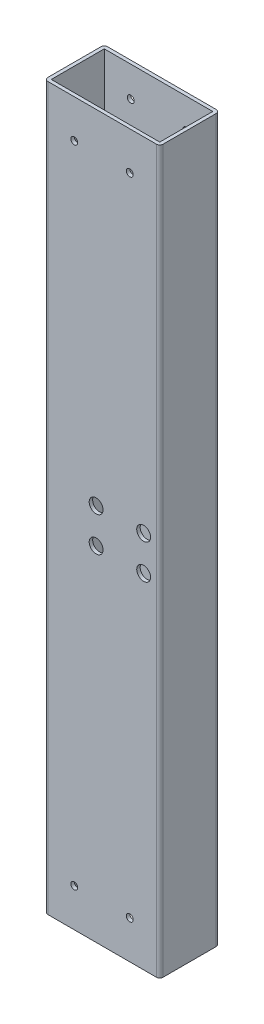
ISO-10303-21;
HEADER;
FILE_DESCRIPTION(('STEP AP214'),'2;1');
FILE_NAME('part.step','',(''),(''),'','','');
FILE_SCHEMA(('AUTOMOTIVE_DESIGN { 1 0 10303 214 1 1 1 1 }'));
ENDSEC;
DATA;
#1=APPLICATION_CONTEXT('core data for automotive mechanical design processes');
#2=APPLICATION_PROTOCOL_DEFINITION('international standard','automotive_design',2000,#1);
#3=PRODUCT_CONTEXT('',#1,'mechanical');
#4=PRODUCT('Part','Part','',(#3));
#5=PRODUCT_RELATED_PRODUCT_CATEGORY('part','',(#4));
#6=PRODUCT_DEFINITION_FORMATION('','',#4);
#7=PRODUCT_DEFINITION_CONTEXT('part definition',#1,'design');
#8=PRODUCT_DEFINITION('design','',#6,#7);
#9=PRODUCT_DEFINITION_SHAPE('','',#8);
#10=(LENGTH_UNIT() NAMED_UNIT(*) SI_UNIT(.MILLI.,.METRE.));
#11=(NAMED_UNIT(*) PLANE_ANGLE_UNIT() SI_UNIT($,.RADIAN.));
#12=(NAMED_UNIT(*) SI_UNIT($,.STERADIAN.) SOLID_ANGLE_UNIT());
#13=UNCERTAINTY_MEASURE_WITH_UNIT(LENGTH_MEASURE(1.E-05),#10,'distance_accuracy_value','');
#14=(GEOMETRIC_REPRESENTATION_CONTEXT(3) GLOBAL_UNCERTAINTY_ASSIGNED_CONTEXT((#13)) GLOBAL_UNIT_ASSIGNED_CONTEXT((#10,
#11,#12)) REPRESENTATION_CONTEXT('',''));
#15=CARTESIAN_POINT('',(0.,0.,0.));
#16=DIRECTION('',(0.,0.,1.));
#17=DIRECTION('',(1.,0.,0.));
#18=AXIS2_PLACEMENT_3D('',#15,#16,#17);
#19=CARTESIAN_POINT('',(-24.8285,165.1,12.1285));
#20=DIRECTION('',(0.,1.,0.));
#21=DIRECTION('',(0.,0.,1.));
#22=AXIS2_PLACEMENT_3D('',#19,#20,#21);
#23=PLANE('',#22);
#24=CARTESIAN_POINT('',(-24.8285,165.1,12.1285));
#25=DIRECTION('',(0.,1.,0.));
#26=DIRECTION('',(0.,0.,-1.));
#27=AXIS2_PLACEMENT_3D('',#24,#25,#26);
#28=CIRCLE('',#27,1.5875);
#29=CARTESIAN_POINT('',(-26.416,165.1,12.1285));
#30=VERTEX_POINT('',#29);
#31=CARTESIAN_POINT('',(-24.8285,165.1,13.716));
#32=VERTEX_POINT('',#31);
#33=EDGE_CURVE('E210',#30,#32,#28,.T.);
#34=ORIENTED_EDGE('',*,*,#33,.T.);
#35=DIRECTION('',(1.,0.,0.));
#36=VECTOR('',#35,1.);
#37=CARTESIAN_POINT('',(-24.8285,165.1,13.716));
#38=LINE('',#37,#36);
#39=CARTESIAN_POINT('',(24.8285,165.1,13.716));
#40=VERTEX_POINT('',#39);
#41=EDGE_CURVE('E213',#32,#40,#38,.T.);
#42=ORIENTED_EDGE('',*,*,#41,.T.);
#43=CARTESIAN_POINT('',(24.8285,165.1,12.1285));
#44=DIRECTION('',(0.,1.,0.));
#45=DIRECTION('',(0.,0.,1.));
#46=AXIS2_PLACEMENT_3D('',#43,#44,#45);
#47=CIRCLE('',#46,1.5875);
#48=CARTESIAN_POINT('',(26.416,165.1,12.1285));
#49=VERTEX_POINT('',#48);
#50=EDGE_CURVE('E216',#40,#49,#47,.T.);
#51=ORIENTED_EDGE('',*,*,#50,.T.);
#52=DIRECTION('',(0.,0.,-1.));
#53=VECTOR('',#52,1.);
#54=CARTESIAN_POINT('',(26.416,165.1,12.1285));
#55=LINE('',#54,#53);
#56=CARTESIAN_POINT('',(26.416,165.1,-12.1285));
#57=VERTEX_POINT('',#56);
#58=EDGE_CURVE('E218',#49,#57,#55,.T.);
#59=ORIENTED_EDGE('',*,*,#58,.T.);
#60=CARTESIAN_POINT('',(24.8285,165.1,-12.1285));
#61=DIRECTION('',(0.,1.,0.));
#62=DIRECTION('',(0.,0.,-1.));
#63=AXIS2_PLACEMENT_3D('',#60,#61,#62);
#64=CIRCLE('',#63,1.5875);
#65=CARTESIAN_POINT('',(24.8285,165.1,-13.716));
#66=VERTEX_POINT('',#65);
#67=EDGE_CURVE('E220',#57,#66,#64,.T.);
#68=ORIENTED_EDGE('',*,*,#67,.T.);
#69=DIRECTION('',(-1.,0.,0.));
#70=VECTOR('',#69,1.);
#71=CARTESIAN_POINT('',(-24.8285,165.1,-13.716));
#72=LINE('',#71,#70);
#73=CARTESIAN_POINT('',(-24.8285,165.1,-13.716));
#74=VERTEX_POINT('',#73);
#75=EDGE_CURVE('E222',#66,#74,#72,.T.);
#76=ORIENTED_EDGE('',*,*,#75,.T.);
#77=CARTESIAN_POINT('',(-24.8285,165.1,-12.1285));
#78=DIRECTION('',(0.,1.,0.));
#79=DIRECTION('',(0.,0.,-1.));
#80=AXIS2_PLACEMENT_3D('',#77,#78,#79);
#81=CIRCLE('',#80,1.5875);
#82=CARTESIAN_POINT('',(-26.416,165.1,-12.1285));
#83=VERTEX_POINT('',#82);
#84=EDGE_CURVE('E224',#74,#83,#81,.T.);
#85=ORIENTED_EDGE('',*,*,#84,.T.);
#86=DIRECTION('',(0.,0.,1.));
#87=VECTOR('',#86,1.);
#88=CARTESIAN_POINT('',(-26.416,165.1,12.1285));
#89=LINE('',#88,#87);
#90=EDGE_CURVE('E226',#83,#30,#89,.T.);
#91=ORIENTED_EDGE('',*,*,#90,.T.);
#92=EDGE_LOOP('',(#34,#42,#51,#59,#68,#76,#85,#91));
#93=FACE_BOUND('',#92,.T.);
#94=DIRECTION('',(1.,0.,0.));
#95=VECTOR('',#94,1.);
#96=CARTESIAN_POINT('',(-24.8285,165.1,12.1285));
#97=LINE('',#96,#95);
#98=CARTESIAN_POINT('',(-24.8285,165.1,12.1285));
#99=VERTEX_POINT('',#98);
#100=CARTESIAN_POINT('',(24.8285,165.1,12.1285));
#101=VERTEX_POINT('',#100);
#102=EDGE_CURVE('E180',#99,#101,#97,.T.);
#103=ORIENTED_EDGE('',*,*,#102,.F.);
#104=DIRECTION('',(0.,0.,1.));
#105=VECTOR('',#104,1.);
#106=CARTESIAN_POINT('',(-24.8285,165.1,12.1285));
#107=LINE('',#106,#105);
#108=CARTESIAN_POINT('',(-24.8285,165.1,-12.1285));
#109=VERTEX_POINT('',#108);
#110=EDGE_CURVE('E172',#109,#99,#107,.T.);
#111=ORIENTED_EDGE('',*,*,#110,.F.);
#112=DIRECTION('',(-1.,0.,0.));
#113=VECTOR('',#112,1.);
#114=CARTESIAN_POINT('',(-24.8285,165.1,-12.1285));
#115=LINE('',#114,#113);
#116=CARTESIAN_POINT('',(24.8285,165.1,-12.1285));
#117=VERTEX_POINT('',#116);
#118=EDGE_CURVE('E194',#117,#109,#115,.T.);
#119=ORIENTED_EDGE('',*,*,#118,.F.);
#120=DIRECTION('',(0.,0.,-1.));
#121=VECTOR('',#120,1.);
#122=CARTESIAN_POINT('',(24.8285,165.1,12.1285));
#123=LINE('',#122,#121);
#124=EDGE_CURVE('E192',#101,#117,#123,.T.);
#125=ORIENTED_EDGE('',*,*,#124,.F.);
#126=EDGE_LOOP('',(#103,#111,#119,#125));
#127=FACE_BOUND('',#126,.T.);
#128=ADVANCED_FACE('F81',(#93,#127),#23,.T.);
#129=CARTESIAN_POINT('',(-24.8285,-165.1,12.1285));
#130=DIRECTION('',(0.,1.,0.));
#131=DIRECTION('',(0.,0.,1.));
#132=AXIS2_PLACEMENT_3D('',#129,#130,#131);
#133=PLANE('',#132);
#134=CARTESIAN_POINT('',(-24.8285,-165.1,12.1285));
#135=DIRECTION('',(0.,1.,0.));
#136=DIRECTION('',(0.,0.,-1.));
#137=AXIS2_PLACEMENT_3D('',#134,#135,#136);
#138=CIRCLE('',#137,1.5875);
#139=CARTESIAN_POINT('',(-26.416,-165.1,12.1285));
#140=VERTEX_POINT('',#139);
#141=CARTESIAN_POINT('',(-24.8285,-165.1,13.716));
#142=VERTEX_POINT('',#141);
#143=EDGE_CURVE('E188',#140,#142,#138,.T.);
#144=ORIENTED_EDGE('',*,*,#143,.F.);
#145=DIRECTION('',(0.,0.,1.));
#146=VECTOR('',#145,1.);
#147=CARTESIAN_POINT('',(-26.416,-165.1,12.1285));
#148=LINE('',#147,#146);
#149=CARTESIAN_POINT('',(-26.416,-165.1,-12.1285));
#150=VERTEX_POINT('',#149);
#151=EDGE_CURVE('E214',#150,#140,#148,.T.);
#152=ORIENTED_EDGE('',*,*,#151,.F.);
#153=CARTESIAN_POINT('',(-24.8285,-165.1,-12.1285));
#154=DIRECTION('',(0.,1.,0.));
#155=DIRECTION('',(0.,0.,-1.));
#156=AXIS2_PLACEMENT_3D('',#153,#154,#155);
#157=CIRCLE('',#156,1.5875);
#158=CARTESIAN_POINT('',(-24.8285,-165.1,-13.716));
#159=VERTEX_POINT('',#158);
#160=EDGE_CURVE('E241',#159,#150,#157,.T.);
#161=ORIENTED_EDGE('',*,*,#160,.F.);
#162=DIRECTION('',(-1.,0.,0.));
#163=VECTOR('',#162,1.);
#164=CARTESIAN_POINT('',(-24.8285,-165.1,-13.716));
#165=LINE('',#164,#163);
#166=CARTESIAN_POINT('',(24.8285,-165.1,-13.716));
#167=VERTEX_POINT('',#166);
#168=EDGE_CURVE('E239',#167,#159,#165,.T.);
#169=ORIENTED_EDGE('',*,*,#168,.F.);
#170=CARTESIAN_POINT('',(24.8285,-165.1,-12.1285));
#171=DIRECTION('',(0.,1.,0.));
#172=DIRECTION('',(0.,0.,-1.));
#173=AXIS2_PLACEMENT_3D('',#170,#171,#172);
#174=CIRCLE('',#173,1.5875);
#175=CARTESIAN_POINT('',(26.416,-165.1,-12.1285));
#176=VERTEX_POINT('',#175);
#177=EDGE_CURVE('E237',#176,#167,#174,.T.);
#178=ORIENTED_EDGE('',*,*,#177,.F.);
#179=DIRECTION('',(0.,0.,-1.));
#180=VECTOR('',#179,1.);
#181=CARTESIAN_POINT('',(26.416,-165.1,12.1285));
#182=LINE('',#181,#180);
#183=CARTESIAN_POINT('',(26.416,-165.1,12.1285));
#184=VERTEX_POINT('',#183);
#185=EDGE_CURVE('E235',#184,#176,#182,.T.);
#186=ORIENTED_EDGE('',*,*,#185,.F.);
#187=CARTESIAN_POINT('',(24.8285,-165.1,12.1285));
#188=DIRECTION('',(0.,1.,0.));
#189=DIRECTION('',(0.,0.,1.));
#190=AXIS2_PLACEMENT_3D('',#187,#188,#189);
#191=CIRCLE('',#190,1.5875);
#192=CARTESIAN_POINT('',(24.8285,-165.1,13.716));
#193=VERTEX_POINT('',#192);
#194=EDGE_CURVE('E233',#193,#184,#191,.T.);
#195=ORIENTED_EDGE('',*,*,#194,.F.);
#196=DIRECTION('',(1.,0.,0.));
#197=VECTOR('',#196,1.);
#198=CARTESIAN_POINT('',(-24.8285,-165.1,13.716));
#199=LINE('',#198,#197);
#200=EDGE_CURVE('E231',#142,#193,#199,.T.);
#201=ORIENTED_EDGE('',*,*,#200,.F.);
#202=EDGE_LOOP('',(#144,#152,#161,#169,#178,#186,#195,#201));
#203=FACE_BOUND('',#202,.T.);
#204=DIRECTION('',(0.,0.,1.));
#205=VECTOR('',#204,1.);
#206=CARTESIAN_POINT('',(-24.8285,-165.1,12.1285));
#207=LINE('',#206,#205);
#208=CARTESIAN_POINT('',(-24.8285,-165.1,-12.1285));
#209=VERTEX_POINT('',#208);
#210=CARTESIAN_POINT('',(-24.8285,-165.1,12.1285));
#211=VERTEX_POINT('',#210);
#212=EDGE_CURVE('E106',#209,#211,#207,.T.);
#213=ORIENTED_EDGE('',*,*,#212,.T.);
#214=DIRECTION('',(1.,0.,0.));
#215=VECTOR('',#214,1.);
#216=CARTESIAN_POINT('',(-24.8285,-165.1,12.1285));
#217=LINE('',#216,#215);
#218=CARTESIAN_POINT('',(24.8285,-165.1,12.1285));
#219=VERTEX_POINT('',#218);
#220=EDGE_CURVE('E187',#211,#219,#217,.T.);
#221=ORIENTED_EDGE('',*,*,#220,.T.);
#222=DIRECTION('',(0.,0.,-1.));
#223=VECTOR('',#222,1.);
#224=CARTESIAN_POINT('',(24.8285,-165.1,12.1285));
#225=LINE('',#224,#223);
#226=CARTESIAN_POINT('',(24.8285,-165.1,-12.1285));
#227=VERTEX_POINT('',#226);
#228=EDGE_CURVE('E202',#219,#227,#225,.T.);
#229=ORIENTED_EDGE('',*,*,#228,.T.);
#230=DIRECTION('',(-1.,0.,0.));
#231=VECTOR('',#230,1.);
#232=CARTESIAN_POINT('',(-24.8285,-165.1,-12.1285));
#233=LINE('',#232,#231);
#234=EDGE_CURVE('E181',#227,#209,#233,.T.);
#235=ORIENTED_EDGE('',*,*,#234,.T.);
#236=EDGE_LOOP('',(#213,#221,#229,#235));
#237=FACE_BOUND('',#236,.T.);
#238=ADVANCED_FACE('F357',(#203,#237),#133,.F.);
#239=CARTESIAN_POINT('',(-24.8285,165.1,12.1285));
#240=DIRECTION('',(0.,-1.,0.));
#241=DIRECTION('',(0.,0.,-1.));
#242=AXIS2_PLACEMENT_3D('',#239,#240,#241);
#243=CYLINDRICAL_SURFACE('',#242,1.5875);
#244=ORIENTED_EDGE('',*,*,#143,.T.);
#245=DIRECTION('',(0.,-1.,0.));
#246=VECTOR('',#245,1.);
#247=CARTESIAN_POINT('',(-24.8285,165.1,13.716));
#248=LINE('',#247,#246);
#249=EDGE_CURVE('E12',#32,#142,#248,.T.);
#250=ORIENTED_EDGE('',*,*,#249,.F.);
#251=ORIENTED_EDGE('',*,*,#33,.F.);
#252=DIRECTION('',(0.,-1.,0.));
#253=VECTOR('',#252,1.);
#254=CARTESIAN_POINT('',(-26.416,165.1,12.1285));
#255=LINE('',#254,#253);
#256=EDGE_CURVE('E228',#30,#140,#255,.T.);
#257=ORIENTED_EDGE('',*,*,#256,.T.);
#258=EDGE_LOOP('',(#244,#250,#251,#257));
#259=FACE_BOUND('',#258,.T.);
#260=ADVANCED_FACE('F83',(#259),#243,.T.);
#261=CARTESIAN_POINT('',(-24.8285,165.1,13.716));
#262=DIRECTION('',(0.,0.,-1.));
#263=DIRECTION('',(-1.,0.,0.));
#264=AXIS2_PLACEMENT_3D('',#261,#262,#263);
#265=PLANE('',#264);
#266=CARTESIAN_POINT('',(-2.69999999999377,7.93750000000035,13.716));
#267=DIRECTION('',(0.,0.,-1.));
#268=DIRECTION('',(-1.,0.,0.));
#269=AXIS2_PLACEMENT_3D('',#266,#267,#268);
#270=CIRCLE('',#269,3.175);
#271=CARTESIAN_POINT('',(-5.87499999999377,7.93750000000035,13.716));
#272=VERTEX_POINT('',#271);
#273=EDGE_CURVE('E401',#272,#272,#270,.T.);
#274=ORIENTED_EDGE('',*,*,#273,.T.);
#275=EDGE_LOOP('',(#274));
#276=FACE_BOUND('',#275,.T.);
#277=CARTESIAN_POINT('',(-2.69999999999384,-7.93749999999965,13.716));
#278=DIRECTION('',(0.,0.,-1.));
#279=DIRECTION('',(-1.,0.,0.));
#280=AXIS2_PLACEMENT_3D('',#277,#278,#279);
#281=CIRCLE('',#280,3.175);
#282=CARTESIAN_POINT('',(-5.87499999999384,-7.93749999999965,13.716));
#283=VERTEX_POINT('',#282);
#284=EDGE_CURVE('E405',#283,#283,#281,.T.);
#285=ORIENTED_EDGE('',*,*,#284,.T.);
#286=EDGE_LOOP('',(#285));
#287=FACE_BOUND('',#286,.T.);
#288=CARTESIAN_POINT('',(19.0500000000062,-7.93749999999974,13.716));
#289=DIRECTION('',(0.,0.,-1.));
#290=DIRECTION('',(-1.,0.,0.));
#291=AXIS2_PLACEMENT_3D('',#288,#289,#290);
#292=CIRCLE('',#291,3.175);
#293=CARTESIAN_POINT('',(15.8750000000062,-7.93749999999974,13.716));
#294=VERTEX_POINT('',#293);
#295=EDGE_CURVE('E409',#294,#294,#292,.T.);
#296=ORIENTED_EDGE('',*,*,#295,.T.);
#297=EDGE_LOOP('',(#296));
#298=FACE_BOUND('',#297,.T.);
#299=CARTESIAN_POINT('',(19.0500000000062,7.93750000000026,13.716));
#300=DIRECTION('',(0.,0.,-1.));
#301=DIRECTION('',(-1.,0.,0.));
#302=AXIS2_PLACEMENT_3D('',#299,#300,#301);
#303=CIRCLE('',#302,3.175);
#304=CARTESIAN_POINT('',(15.8750000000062,7.93750000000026,13.716));
#305=VERTEX_POINT('',#304);
#306=EDGE_CURVE('E293',#305,#305,#303,.T.);
#307=ORIENTED_EDGE('',*,*,#306,.T.);
#308=EDGE_LOOP('',(#307));
#309=FACE_BOUND('',#308,.T.);
#310=CARTESIAN_POINT('',(12.699999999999,147.6375,13.716));
#311=DIRECTION('',(0.,0.,1.));
#312=DIRECTION('',(1.,0.,0.));
#313=AXIS2_PLACEMENT_3D('',#310,#311,#312);
#314=CIRCLE('',#313,1.58749999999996);
#315=CARTESIAN_POINT('',(14.2874999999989,147.6375,13.716));
#316=VERTEX_POINT('',#315);
#317=EDGE_CURVE('E314',#316,#316,#314,.T.);
#318=ORIENTED_EDGE('',*,*,#317,.F.);
#319=EDGE_LOOP('',(#318));
#320=FACE_BOUND('',#319,.T.);
#321=CARTESIAN_POINT('',(-12.6999999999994,147.6375,13.716));
#322=DIRECTION('',(0.,0.,1.));
#323=DIRECTION('',(1.,0.,0.));
#324=AXIS2_PLACEMENT_3D('',#321,#322,#323);
#325=CIRCLE('',#324,1.5875);
#326=CARTESIAN_POINT('',(-11.1124999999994,147.6375,13.716));
#327=VERTEX_POINT('',#326);
#328=EDGE_CURVE('E318',#327,#327,#325,.T.);
#329=ORIENTED_EDGE('',*,*,#328,.F.);
#330=EDGE_LOOP('',(#329));
#331=FACE_BOUND('',#330,.T.);
#332=CARTESIAN_POINT('',(-12.6999999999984,-147.6375,13.716));
#333=DIRECTION('',(0.,0.,1.));
#334=DIRECTION('',(1.,0.,0.));
#335=AXIS2_PLACEMENT_3D('',#332,#333,#334);
#336=CIRCLE('',#335,1.5875);
#337=CARTESIAN_POINT('',(-11.1124999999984,-147.6375,13.716));
#338=VERTEX_POINT('',#337);
#339=EDGE_CURVE('E315',#338,#338,#336,.T.);
#340=ORIENTED_EDGE('',*,*,#339,.F.);
#341=EDGE_LOOP('',(#340));
#342=FACE_BOUND('',#341,.T.);
#343=CARTESIAN_POINT('',(12.7,-147.6375,13.716));
#344=DIRECTION('',(0.,0.,1.));
#345=DIRECTION('',(1.,0.,0.));
#346=AXIS2_PLACEMENT_3D('',#343,#344,#345);
#347=CIRCLE('',#346,1.58749999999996);
#348=CARTESIAN_POINT('',(14.2874999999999,-147.6375,13.716));
#349=VERTEX_POINT('',#348);
#350=EDGE_CURVE('E279',#349,#349,#347,.T.);
#351=ORIENTED_EDGE('',*,*,#350,.F.);
#352=EDGE_LOOP('',(#351));
#353=FACE_BOUND('',#352,.T.);
#354=ORIENTED_EDGE('',*,*,#200,.T.);
#355=DIRECTION('',(0.,-1.,0.));
#356=VECTOR('',#355,1.);
#357=CARTESIAN_POINT('',(24.8285,165.1,13.716));
#358=LINE('',#357,#356);
#359=EDGE_CURVE('E90',#40,#193,#358,.T.);
#360=ORIENTED_EDGE('',*,*,#359,.F.);
#361=ORIENTED_EDGE('',*,*,#41,.F.);
#362=ORIENTED_EDGE('',*,*,#249,.T.);
#363=EDGE_LOOP('',(#354,#360,#361,#362));
#364=FACE_BOUND('',#363,.T.);
#365=ADVANCED_FACE('F389',(#276,#287,#298,#309,#320,#331,#342,#353,#364),#265,.F.);
#366=CARTESIAN_POINT('',(24.8285,165.1,12.1285));
#367=DIRECTION('',(0.,-1.,0.));
#368=DIRECTION('',(0.,0.,-1.));
#369=AXIS2_PLACEMENT_3D('',#366,#367,#368);
#370=CYLINDRICAL_SURFACE('',#369,1.5875);
#371=ORIENTED_EDGE('',*,*,#194,.T.);
#372=DIRECTION('',(0.,-1.,0.));
#373=VECTOR('',#372,1.);
#374=CARTESIAN_POINT('',(26.416,165.1,12.1285));
#375=LINE('',#374,#373);
#376=EDGE_CURVE('E258',#49,#184,#375,.T.);
#377=ORIENTED_EDGE('',*,*,#376,.F.);
#378=ORIENTED_EDGE('',*,*,#50,.F.);
#379=ORIENTED_EDGE('',*,*,#359,.T.);
#380=EDGE_LOOP('',(#371,#377,#378,#379));
#381=FACE_BOUND('',#380,.T.);
#382=ADVANCED_FACE('F386',(#381),#370,.T.);
#383=CARTESIAN_POINT('',(26.416,165.1,12.1285));
#384=DIRECTION('',(-1.,0.,0.));
#385=DIRECTION('',(0.,0.,1.));
#386=AXIS2_PLACEMENT_3D('',#383,#384,#385);
#387=PLANE('',#386);
#388=ORIENTED_EDGE('',*,*,#185,.T.);
#389=DIRECTION('',(0.,-1.,0.));
#390=VECTOR('',#389,1.);
#391=CARTESIAN_POINT('',(26.416,165.1,-12.1285));
#392=LINE('',#391,#390);
#393=EDGE_CURVE('E255',#57,#176,#392,.T.);
#394=ORIENTED_EDGE('',*,*,#393,.F.);
#395=ORIENTED_EDGE('',*,*,#58,.F.);
#396=ORIENTED_EDGE('',*,*,#376,.T.);
#397=EDGE_LOOP('',(#388,#394,#395,#396));
#398=FACE_BOUND('',#397,.T.);
#399=ADVANCED_FACE('F382',(#398),#387,.F.);
#400=CARTESIAN_POINT('',(24.8285,165.1,-12.1285));
#401=DIRECTION('',(0.,-1.,0.));
#402=DIRECTION('',(0.,0.,-1.));
#403=AXIS2_PLACEMENT_3D('',#400,#401,#402);
#404=CYLINDRICAL_SURFACE('',#403,1.5875);
#405=ORIENTED_EDGE('',*,*,#177,.T.);
#406=DIRECTION('',(0.,-1.,0.));
#407=VECTOR('',#406,1.);
#408=CARTESIAN_POINT('',(24.8285,165.1,-13.716));
#409=LINE('',#408,#407);
#410=EDGE_CURVE('E252',#66,#167,#409,.T.);
#411=ORIENTED_EDGE('',*,*,#410,.F.);
#412=ORIENTED_EDGE('',*,*,#67,.F.);
#413=ORIENTED_EDGE('',*,*,#393,.T.);
#414=EDGE_LOOP('',(#405,#411,#412,#413));
#415=FACE_BOUND('',#414,.T.);
#416=ADVANCED_FACE('F378',(#415),#404,.T.);
#417=CARTESIAN_POINT('',(-24.8285,165.1,-13.716));
#418=DIRECTION('',(0.,0.,1.));
#419=DIRECTION('',(1.,0.,0.));
#420=AXIS2_PLACEMENT_3D('',#417,#418,#419);
#421=PLANE('',#420);
#422=CARTESIAN_POINT('',(-2.69999999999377,7.93750000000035,-13.716));
#423=DIRECTION('',(0.,0.,-1.));
#424=DIRECTION('',(-1.,0.,0.));
#425=AXIS2_PLACEMENT_3D('',#422,#423,#424);
#426=CIRCLE('',#425,3.175);
#427=CARTESIAN_POINT('',(-5.87499999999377,7.93750000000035,-13.716));
#428=VERTEX_POINT('',#427);
#429=EDGE_CURVE('E615',#428,#428,#426,.T.);
#430=ORIENTED_EDGE('',*,*,#429,.F.);
#431=EDGE_LOOP('',(#430));
#432=FACE_BOUND('',#431,.T.);
#433=CARTESIAN_POINT('',(-2.69999999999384,-7.93749999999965,-13.716));
#434=DIRECTION('',(0.,0.,-1.));
#435=DIRECTION('',(-1.,0.,0.));
#436=AXIS2_PLACEMENT_3D('',#433,#434,#435);
#437=CIRCLE('',#436,3.175);
#438=CARTESIAN_POINT('',(-5.87499999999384,-7.93749999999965,-13.716));
#439=VERTEX_POINT('',#438);
#440=EDGE_CURVE('E630',#439,#439,#437,.T.);
#441=ORIENTED_EDGE('',*,*,#440,.F.);
#442=EDGE_LOOP('',(#441));
#443=FACE_BOUND('',#442,.T.);
#444=CARTESIAN_POINT('',(19.0500000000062,-7.93749999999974,-13.716));
#445=DIRECTION('',(0.,0.,-1.));
#446=DIRECTION('',(-1.,0.,0.));
#447=AXIS2_PLACEMENT_3D('',#444,#445,#446);
#448=CIRCLE('',#447,3.175);
#449=CARTESIAN_POINT('',(15.8750000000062,-7.93749999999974,-13.716));
#450=VERTEX_POINT('',#449);
#451=EDGE_CURVE('E623',#450,#450,#448,.T.);
#452=ORIENTED_EDGE('',*,*,#451,.F.);
#453=EDGE_LOOP('',(#452));
#454=FACE_BOUND('',#453,.T.);
#455=CARTESIAN_POINT('',(19.0500000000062,7.93750000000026,-13.716));
#456=DIRECTION('',(0.,0.,-1.));
#457=DIRECTION('',(-1.,0.,0.));
#458=AXIS2_PLACEMENT_3D('',#455,#456,#457);
#459=CIRCLE('',#458,3.175);
#460=CARTESIAN_POINT('',(15.8750000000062,7.93750000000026,-13.716));
#461=VERTEX_POINT('',#460);
#462=EDGE_CURVE('E621',#461,#461,#459,.T.);
#463=ORIENTED_EDGE('',*,*,#462,.F.);
#464=EDGE_LOOP('',(#463));
#465=FACE_BOUND('',#464,.T.);
#466=CARTESIAN_POINT('',(-12.6999999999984,-151.257,-13.716));
#467=DIRECTION('',(0.,0.,1.));
#468=DIRECTION('',(1.,0.,0.));
#469=AXIS2_PLACEMENT_3D('',#466,#467,#468);
#470=CIRCLE('',#469,1.5875);
#471=CARTESIAN_POINT('',(-11.1124999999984,-151.257,-13.716));
#472=VERTEX_POINT('',#471);
#473=EDGE_CURVE('E288',#472,#472,#470,.T.);
#474=ORIENTED_EDGE('',*,*,#473,.T.);
#475=EDGE_LOOP('',(#474));
#476=FACE_BOUND('',#475,.T.);
#477=CARTESIAN_POINT('',(12.7,-151.257,-13.716));
#478=DIRECTION('',(0.,0.,1.));
#479=DIRECTION('',(1.,0.,0.));
#480=AXIS2_PLACEMENT_3D('',#477,#478,#479);
#481=CIRCLE('',#480,1.5875);
#482=CARTESIAN_POINT('',(14.2875,-151.257,-13.716));
#483=VERTEX_POINT('',#482);
#484=EDGE_CURVE('E328',#483,#483,#481,.T.);
#485=ORIENTED_EDGE('',*,*,#484,.T.);
#486=EDGE_LOOP('',(#485));
#487=FACE_BOUND('',#486,.T.);
#488=CARTESIAN_POINT('',(12.7,151.257,-13.716));
#489=DIRECTION('',(0.,0.,1.));
#490=DIRECTION('',(1.,0.,0.));
#491=AXIS2_PLACEMENT_3D('',#488,#489,#490);
#492=CIRCLE('',#491,1.5875);
#493=CARTESIAN_POINT('',(14.2875,151.257,-13.716));
#494=VERTEX_POINT('',#493);
#495=EDGE_CURVE('E325',#494,#494,#492,.T.);
#496=ORIENTED_EDGE('',*,*,#495,.T.);
#497=EDGE_LOOP('',(#496));
#498=FACE_BOUND('',#497,.T.);
#499=CARTESIAN_POINT('',(-12.7,151.257,-13.716));
#500=DIRECTION('',(0.,0.,1.));
#501=DIRECTION('',(1.,0.,0.));
#502=AXIS2_PLACEMENT_3D('',#499,#500,#501);
#503=CIRCLE('',#502,1.5875);
#504=CARTESIAN_POINT('',(-11.1125,151.257,-13.716));
#505=VERTEX_POINT('',#504);
#506=EDGE_CURVE('E267',#505,#505,#503,.T.);
#507=ORIENTED_EDGE('',*,*,#506,.T.);
#508=EDGE_LOOP('',(#507));
#509=FACE_BOUND('',#508,.T.);
#510=ORIENTED_EDGE('',*,*,#168,.T.);
#511=DIRECTION('',(0.,-1.,0.));
#512=VECTOR('',#511,1.);
#513=CARTESIAN_POINT('',(-24.8285,165.1,-13.716));
#514=LINE('',#513,#512);
#515=EDGE_CURVE('E249',#74,#159,#514,.T.);
#516=ORIENTED_EDGE('',*,*,#515,.F.);
#517=ORIENTED_EDGE('',*,*,#75,.F.);
#518=ORIENTED_EDGE('',*,*,#410,.T.);
#519=EDGE_LOOP('',(#510,#516,#517,#518));
#520=FACE_BOUND('',#519,.T.);
#521=ADVANCED_FACE('F335',(#432,#443,#454,#465,#476,#487,#498,#509,#520),#421,.F.);
#522=CARTESIAN_POINT('',(-24.8285,165.1,-12.1285));
#523=DIRECTION('',(0.,-1.,0.));
#524=DIRECTION('',(0.,0.,-1.));
#525=AXIS2_PLACEMENT_3D('',#522,#523,#524);
#526=CYLINDRICAL_SURFACE('',#525,1.5875);
#527=ORIENTED_EDGE('',*,*,#160,.T.);
#528=DIRECTION('',(0.,-1.,0.));
#529=VECTOR('',#528,1.);
#530=CARTESIAN_POINT('',(-26.416,165.1,-12.1285));
#531=LINE('',#530,#529);
#532=EDGE_CURVE('E246',#83,#150,#531,.T.);
#533=ORIENTED_EDGE('',*,*,#532,.F.);
#534=ORIENTED_EDGE('',*,*,#84,.F.);
#535=ORIENTED_EDGE('',*,*,#515,.T.);
#536=EDGE_LOOP('',(#527,#533,#534,#535));
#537=FACE_BOUND('',#536,.T.);
#538=ADVANCED_FACE('F371',(#537),#526,.T.);
#539=CARTESIAN_POINT('',(-26.416,165.1,12.1285));
#540=DIRECTION('',(1.,0.,0.));
#541=DIRECTION('',(0.,0.,-1.));
#542=AXIS2_PLACEMENT_3D('',#539,#540,#541);
#543=PLANE('',#542);
#544=ORIENTED_EDGE('',*,*,#151,.T.);
#545=ORIENTED_EDGE('',*,*,#256,.F.);
#546=ORIENTED_EDGE('',*,*,#90,.F.);
#547=ORIENTED_EDGE('',*,*,#532,.T.);
#548=EDGE_LOOP('',(#544,#545,#546,#547));
#549=FACE_BOUND('',#548,.T.);
#550=ADVANCED_FACE('F368',(#549),#543,.F.);
#551=CARTESIAN_POINT('',(-24.8285,165.1,12.1285));
#552=DIRECTION('',(1.,0.,0.));
#553=DIRECTION('',(0.,0.,-1.));
#554=AXIS2_PLACEMENT_3D('',#551,#552,#553);
#555=PLANE('',#554);
#556=ORIENTED_EDGE('',*,*,#212,.F.);
#557=DIRECTION('',(0.,-1.,0.));
#558=VECTOR('',#557,1.);
#559=CARTESIAN_POINT('',(-24.8285,165.1,-12.1285));
#560=LINE('',#559,#558);
#561=EDGE_CURVE('E176',#109,#209,#560,.T.);
#562=ORIENTED_EDGE('',*,*,#561,.F.);
#563=ORIENTED_EDGE('',*,*,#110,.T.);
#564=DIRECTION('',(0.,-1.,0.));
#565=VECTOR('',#564,1.);
#566=CARTESIAN_POINT('',(-24.8285,165.1,12.1285));
#567=LINE('',#566,#565);
#568=EDGE_CURVE('E175',#99,#211,#567,.T.);
#569=ORIENTED_EDGE('',*,*,#568,.T.);
#570=EDGE_LOOP('',(#556,#562,#563,#569));
#571=FACE_BOUND('',#570,.T.);
#572=ADVANCED_FACE('F174',(#571),#555,.T.);
#573=CARTESIAN_POINT('',(-24.8285,165.1,12.1285));
#574=DIRECTION('',(0.,0.,-1.));
#575=DIRECTION('',(-1.,0.,0.));
#576=AXIS2_PLACEMENT_3D('',#573,#574,#575);
#577=PLANE('',#576);
#578=CARTESIAN_POINT('',(-2.69999999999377,7.93750000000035,12.1285));
#579=DIRECTION('',(0.,0.,-1.));
#580=DIRECTION('',(-1.,0.,0.));
#581=AXIS2_PLACEMENT_3D('',#578,#579,#580);
#582=CIRCLE('',#581,3.175);
#583=CARTESIAN_POINT('',(-5.87499999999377,7.93750000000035,12.1285));
#584=VERTEX_POINT('',#583);
#585=EDGE_CURVE('E311',#584,#584,#582,.T.);
#586=ORIENTED_EDGE('',*,*,#585,.F.);
#587=EDGE_LOOP('',(#586));
#588=FACE_BOUND('',#587,.T.);
#589=CARTESIAN_POINT('',(-2.69999999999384,-7.93749999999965,12.1285));
#590=DIRECTION('',(0.,0.,-1.));
#591=DIRECTION('',(-1.,0.,0.));
#592=AXIS2_PLACEMENT_3D('',#589,#590,#591);
#593=CIRCLE('',#592,3.175);
#594=CARTESIAN_POINT('',(-5.87499999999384,-7.93749999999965,12.1285));
#595=VERTEX_POINT('',#594);
#596=EDGE_CURVE('E299',#595,#595,#593,.T.);
#597=ORIENTED_EDGE('',*,*,#596,.F.);
#598=EDGE_LOOP('',(#597));
#599=FACE_BOUND('',#598,.T.);
#600=CARTESIAN_POINT('',(19.0500000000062,-7.93749999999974,12.1285));
#601=DIRECTION('',(0.,0.,-1.));
#602=DIRECTION('',(-1.,0.,0.));
#603=AXIS2_PLACEMENT_3D('',#600,#601,#602);
#604=CIRCLE('',#603,3.175);
#605=CARTESIAN_POINT('',(15.8750000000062,-7.93749999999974,12.1285));
#606=VERTEX_POINT('',#605);
#607=EDGE_CURVE('E296',#606,#606,#604,.T.);
#608=ORIENTED_EDGE('',*,*,#607,.F.);
#609=EDGE_LOOP('',(#608));
#610=FACE_BOUND('',#609,.T.);
#611=CARTESIAN_POINT('',(19.0500000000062,7.93750000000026,12.1285));
#612=DIRECTION('',(0.,0.,-1.));
#613=DIRECTION('',(-1.,0.,0.));
#614=AXIS2_PLACEMENT_3D('',#611,#612,#613);
#615=CIRCLE('',#614,3.175);
#616=CARTESIAN_POINT('',(15.8750000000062,7.93750000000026,12.1285));
#617=VERTEX_POINT('',#616);
#618=EDGE_CURVE('E292',#617,#617,#615,.T.);
#619=ORIENTED_EDGE('',*,*,#618,.F.);
#620=EDGE_LOOP('',(#619));
#621=FACE_BOUND('',#620,.T.);
#622=CARTESIAN_POINT('',(12.699999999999,147.6375,12.1285));
#623=DIRECTION('',(0.,0.,-1.));
#624=DIRECTION('',(-1.,0.,0.));
#625=AXIS2_PLACEMENT_3D('',#622,#623,#624);
#626=CIRCLE('',#625,1.58749999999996);
#627=CARTESIAN_POINT('',(11.112499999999,147.6375,12.1285));
#628=VERTEX_POINT('',#627);
#629=EDGE_CURVE('E285',#628,#628,#626,.F.);
#630=ORIENTED_EDGE('',*,*,#629,.T.);
#631=EDGE_LOOP('',(#630));
#632=FACE_BOUND('',#631,.T.);
#633=CARTESIAN_POINT('',(-12.6999999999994,147.6375,12.1285));
#634=DIRECTION('',(0.,0.,-1.));
#635=DIRECTION('',(-1.,0.,0.));
#636=AXIS2_PLACEMENT_3D('',#633,#634,#635);
#637=CIRCLE('',#636,1.5875);
#638=CARTESIAN_POINT('',(-14.2874999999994,147.6375,12.1285));
#639=VERTEX_POINT('',#638);
#640=EDGE_CURVE('E282',#639,#639,#637,.F.);
#641=ORIENTED_EDGE('',*,*,#640,.T.);
#642=EDGE_LOOP('',(#641));
#643=FACE_BOUND('',#642,.T.);
#644=CARTESIAN_POINT('',(-12.6999999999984,-147.6375,12.1285));
#645=DIRECTION('',(0.,0.,-1.));
#646=DIRECTION('',(-1.,0.,0.));
#647=AXIS2_PLACEMENT_3D('',#644,#645,#646);
#648=CIRCLE('',#647,1.5875);
#649=CARTESIAN_POINT('',(-14.2874999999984,-147.6375,12.1285));
#650=VERTEX_POINT('',#649);
#651=EDGE_CURVE('E278',#650,#650,#648,.F.);
#652=ORIENTED_EDGE('',*,*,#651,.T.);
#653=EDGE_LOOP('',(#652));
#654=FACE_BOUND('',#653,.T.);
#655=CARTESIAN_POINT('',(12.7,-147.6375,12.1285));
#656=DIRECTION('',(0.,0.,-1.));
#657=DIRECTION('',(-1.,0.,0.));
#658=AXIS2_PLACEMENT_3D('',#655,#656,#657);
#659=CIRCLE('',#658,1.58749999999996);
#660=CARTESIAN_POINT('',(11.1125,-147.6375,12.1285));
#661=VERTEX_POINT('',#660);
#662=EDGE_CURVE('E275',#661,#661,#659,.F.);
#663=ORIENTED_EDGE('',*,*,#662,.T.);
#664=EDGE_LOOP('',(#663));
#665=FACE_BOUND('',#664,.T.);
#666=ORIENTED_EDGE('',*,*,#220,.F.);
#667=ORIENTED_EDGE('',*,*,#568,.F.);
#668=ORIENTED_EDGE('',*,*,#102,.T.);
#669=DIRECTION('',(0.,-1.,0.));
#670=VECTOR('',#669,1.);
#671=CARTESIAN_POINT('',(24.8285,165.1,12.1285));
#672=LINE('',#671,#670);
#673=EDGE_CURVE('E189',#101,#219,#672,.T.);
#674=ORIENTED_EDGE('',*,*,#673,.T.);
#675=EDGE_LOOP('',(#666,#667,#668,#674));
#676=FACE_BOUND('',#675,.T.);
#677=ADVANCED_FACE('F184',(#588,#599,#610,#621,#632,#643,#654,#665,#676),#577,.T.);
#678=CARTESIAN_POINT('',(24.8285,165.1,12.1285));
#679=DIRECTION('',(-1.,0.,0.));
#680=DIRECTION('',(0.,0.,1.));
#681=AXIS2_PLACEMENT_3D('',#678,#679,#680);
#682=PLANE('',#681);
#683=ORIENTED_EDGE('',*,*,#228,.F.);
#684=ORIENTED_EDGE('',*,*,#673,.F.);
#685=ORIENTED_EDGE('',*,*,#124,.T.);
#686=DIRECTION('',(0.,-1.,0.));
#687=VECTOR('',#686,1.);
#688=CARTESIAN_POINT('',(24.8285,165.1,-12.1285));
#689=LINE('',#688,#687);
#690=EDGE_CURVE('E98',#117,#227,#689,.T.);
#691=ORIENTED_EDGE('',*,*,#690,.T.);
#692=EDGE_LOOP('',(#683,#684,#685,#691));
#693=FACE_BOUND('',#692,.T.);
#694=ADVANCED_FACE('F352',(#693),#682,.T.);
#695=CARTESIAN_POINT('',(-24.8285,165.1,-12.1285));
#696=DIRECTION('',(0.,0.,1.));
#697=DIRECTION('',(1.,0.,0.));
#698=AXIS2_PLACEMENT_3D('',#695,#696,#697);
#699=PLANE('',#698);
#700=CARTESIAN_POINT('',(-2.69999999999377,7.93750000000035,-12.1285));
#701=DIRECTION('',(0.,0.,1.));
#702=DIRECTION('',(1.,0.,0.));
#703=AXIS2_PLACEMENT_3D('',#700,#701,#702);
#704=CIRCLE('',#703,3.175);
#705=CARTESIAN_POINT('',(0.475000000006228,7.93750000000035,-12.1285));
#706=VERTEX_POINT('',#705);
#707=EDGE_CURVE('E85',#706,#706,#704,.T.);
#708=ORIENTED_EDGE('',*,*,#707,.F.);
#709=EDGE_LOOP('',(#708));
#710=FACE_BOUND('',#709,.T.);
#711=CARTESIAN_POINT('',(-2.69999999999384,-7.93749999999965,-12.1285));
#712=DIRECTION('',(0.,0.,1.));
#713=DIRECTION('',(1.,0.,0.));
#714=AXIS2_PLACEMENT_3D('',#711,#712,#713);
#715=CIRCLE('',#714,3.175);
#716=CARTESIAN_POINT('',(0.47500000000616,-7.93749999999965,-12.1285));
#717=VERTEX_POINT('',#716);
#718=EDGE_CURVE('E297',#717,#717,#715,.T.);
#719=ORIENTED_EDGE('',*,*,#718,.F.);
#720=EDGE_LOOP('',(#719));
#721=FACE_BOUND('',#720,.T.);
#722=CARTESIAN_POINT('',(19.0500000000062,-7.93749999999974,-12.1285));
#723=DIRECTION('',(0.,0.,1.));
#724=DIRECTION('',(1.,0.,0.));
#725=AXIS2_PLACEMENT_3D('',#722,#723,#724);
#726=CIRCLE('',#725,3.175);
#727=CARTESIAN_POINT('',(22.2250000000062,-7.93749999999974,-12.1285));
#728=VERTEX_POINT('',#727);
#729=EDGE_CURVE('E294',#728,#728,#726,.T.);
#730=ORIENTED_EDGE('',*,*,#729,.F.);
#731=EDGE_LOOP('',(#730));
#732=FACE_BOUND('',#731,.T.);
#733=CARTESIAN_POINT('',(19.0500000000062,7.93750000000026,-12.1285));
#734=DIRECTION('',(0.,0.,1.));
#735=DIRECTION('',(1.,0.,0.));
#736=AXIS2_PLACEMENT_3D('',#733,#734,#735);
#737=CIRCLE('',#736,3.175);
#738=CARTESIAN_POINT('',(22.2250000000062,7.93750000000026,-12.1285));
#739=VERTEX_POINT('',#738);
#740=EDGE_CURVE('E289',#739,#739,#737,.T.);
#741=ORIENTED_EDGE('',*,*,#740,.F.);
#742=EDGE_LOOP('',(#741));
#743=FACE_BOUND('',#742,.T.);
#744=CARTESIAN_POINT('',(-12.6999999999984,-151.257,-12.1285));
#745=DIRECTION('',(0.,0.,1.));
#746=DIRECTION('',(1.,0.,0.));
#747=AXIS2_PLACEMENT_3D('',#744,#745,#746);
#748=CIRCLE('',#747,1.5875);
#749=CARTESIAN_POINT('',(-11.1124999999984,-151.257,-12.1285));
#750=VERTEX_POINT('',#749);
#751=EDGE_CURVE('E200',#750,#750,#748,.T.);
#752=ORIENTED_EDGE('',*,*,#751,.F.);
#753=EDGE_LOOP('',(#752));
#754=FACE_BOUND('',#753,.T.);
#755=CARTESIAN_POINT('',(12.7,-151.257,-12.1285));
#756=DIRECTION('',(0.,0.,1.));
#757=DIRECTION('',(1.,0.,0.));
#758=AXIS2_PLACEMENT_3D('',#755,#756,#757);
#759=CIRCLE('',#758,1.5875);
#760=CARTESIAN_POINT('',(14.2875,-151.257,-12.1285));
#761=VERTEX_POINT('',#760);
#762=EDGE_CURVE('E270',#761,#761,#759,.T.);
#763=ORIENTED_EDGE('',*,*,#762,.F.);
#764=EDGE_LOOP('',(#763));
#765=FACE_BOUND('',#764,.T.);
#766=CARTESIAN_POINT('',(12.7,151.257,-12.1285));
#767=DIRECTION('',(0.,0.,1.));
#768=DIRECTION('',(1.,0.,0.));
#769=AXIS2_PLACEMENT_3D('',#766,#767,#768);
#770=CIRCLE('',#769,1.5875);
#771=CARTESIAN_POINT('',(14.2875,151.257,-12.1285));
#772=VERTEX_POINT('',#771);
#773=EDGE_CURVE('E266',#772,#772,#770,.T.);
#774=ORIENTED_EDGE('',*,*,#773,.F.);
#775=EDGE_LOOP('',(#774));
#776=FACE_BOUND('',#775,.T.);
#777=CARTESIAN_POINT('',(-12.7,151.257,-12.1285));
#778=DIRECTION('',(0.,0.,1.));
#779=DIRECTION('',(1.,0.,0.));
#780=AXIS2_PLACEMENT_3D('',#777,#778,#779);
#781=CIRCLE('',#780,1.5875);
#782=CARTESIAN_POINT('',(-11.1125,151.257,-12.1285));
#783=VERTEX_POINT('',#782);
#784=EDGE_CURVE('E263',#783,#783,#781,.T.);
#785=ORIENTED_EDGE('',*,*,#784,.F.);
#786=EDGE_LOOP('',(#785));
#787=FACE_BOUND('',#786,.T.);
#788=ORIENTED_EDGE('',*,*,#234,.F.);
#789=ORIENTED_EDGE('',*,*,#690,.F.);
#790=ORIENTED_EDGE('',*,*,#118,.T.);
#791=ORIENTED_EDGE('',*,*,#561,.T.);
#792=EDGE_LOOP('',(#788,#789,#790,#791));
#793=FACE_BOUND('',#792,.T.);
#794=ADVANCED_FACE('F341',(#710,#721,#732,#743,#754,#765,#776,#787,#793),#699,.T.);
#795=CARTESIAN_POINT('',(-12.7,151.257,-13.716));
#796=DIRECTION('',(0.,0.,1.));
#797=DIRECTION('',(1.,0.,0.));
#798=AXIS2_PLACEMENT_3D('',#795,#796,#797);
#799=CYLINDRICAL_SURFACE('',#798,1.5875);
#800=ORIENTED_EDGE('',*,*,#784,.T.);
#801=EDGE_LOOP('',(#800));
#802=FACE_BOUND('',#801,.T.);
#803=ORIENTED_EDGE('',*,*,#506,.F.);
#804=EDGE_LOOP('',(#803));
#805=FACE_BOUND('',#804,.T.);
#806=ADVANCED_FACE('F338',(#802,#805),#799,.F.);
#807=CARTESIAN_POINT('',(12.7,151.257,-13.716));
#808=DIRECTION('',(0.,0.,1.));
#809=DIRECTION('',(1.,0.,0.));
#810=AXIS2_PLACEMENT_3D('',#807,#808,#809);
#811=CYLINDRICAL_SURFACE('',#810,1.5875);
#812=ORIENTED_EDGE('',*,*,#773,.T.);
#813=EDGE_LOOP('',(#812));
#814=FACE_BOUND('',#813,.T.);
#815=ORIENTED_EDGE('',*,*,#495,.F.);
#816=EDGE_LOOP('',(#815));
#817=FACE_BOUND('',#816,.T.);
#818=ADVANCED_FACE('F340',(#814,#817),#811,.F.);
#819=CARTESIAN_POINT('',(12.7,-151.257,-13.716));
#820=DIRECTION('',(0.,0.,1.));
#821=DIRECTION('',(1.,0.,0.));
#822=AXIS2_PLACEMENT_3D('',#819,#820,#821);
#823=CYLINDRICAL_SURFACE('',#822,1.5875);
#824=ORIENTED_EDGE('',*,*,#762,.T.);
#825=EDGE_LOOP('',(#824));
#826=FACE_BOUND('',#825,.T.);
#827=ORIENTED_EDGE('',*,*,#484,.F.);
#828=EDGE_LOOP('',(#827));
#829=FACE_BOUND('',#828,.T.);
#830=ADVANCED_FACE('F348',(#826,#829),#823,.F.);
#831=CARTESIAN_POINT('',(-12.6999999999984,-151.257,-13.716));
#832=DIRECTION('',(0.,0.,1.));
#833=DIRECTION('',(1.,0.,0.));
#834=AXIS2_PLACEMENT_3D('',#831,#832,#833);
#835=CYLINDRICAL_SURFACE('',#834,1.5875);
#836=ORIENTED_EDGE('',*,*,#751,.T.);
#837=EDGE_LOOP('',(#836));
#838=FACE_BOUND('',#837,.T.);
#839=ORIENTED_EDGE('',*,*,#473,.F.);
#840=EDGE_LOOP('',(#839));
#841=FACE_BOUND('',#840,.T.);
#842=ADVANCED_FACE('F474',(#838,#841),#835,.F.);
#843=CARTESIAN_POINT('',(12.7,-147.6375,13.716));
#844=DIRECTION('',(0.,0.,-1.));
#845=DIRECTION('',(-1.,0.,0.));
#846=AXIS2_PLACEMENT_3D('',#843,#844,#845);
#847=CYLINDRICAL_SURFACE('',#846,1.58749999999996);
#848=ORIENTED_EDGE('',*,*,#662,.F.);
#849=EDGE_LOOP('',(#848));
#850=FACE_BOUND('',#849,.T.);
#851=ORIENTED_EDGE('',*,*,#350,.T.);
#852=EDGE_LOOP('',(#851));
#853=FACE_BOUND('',#852,.T.);
#854=ADVANCED_FACE('F470',(#850,#853),#847,.F.);
#855=CARTESIAN_POINT('',(-12.6999999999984,-147.6375,13.716));
#856=DIRECTION('',(0.,0.,-1.));
#857=DIRECTION('',(-1.,0.,0.));
#858=AXIS2_PLACEMENT_3D('',#855,#856,#857);
#859=CYLINDRICAL_SURFACE('',#858,1.5875);
#860=ORIENTED_EDGE('',*,*,#651,.F.);
#861=EDGE_LOOP('',(#860));
#862=FACE_BOUND('',#861,.T.);
#863=ORIENTED_EDGE('',*,*,#339,.T.);
#864=EDGE_LOOP('',(#863));
#865=FACE_BOUND('',#864,.T.);
#866=ADVANCED_FACE('F473',(#862,#865),#859,.F.);
#867=CARTESIAN_POINT('',(-12.6999999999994,147.6375,13.716));
#868=DIRECTION('',(0.,0.,-1.));
#869=DIRECTION('',(-1.,0.,0.));
#870=AXIS2_PLACEMENT_3D('',#867,#868,#869);
#871=CYLINDRICAL_SURFACE('',#870,1.5875);
#872=ORIENTED_EDGE('',*,*,#640,.F.);
#873=EDGE_LOOP('',(#872));
#874=FACE_BOUND('',#873,.T.);
#875=ORIENTED_EDGE('',*,*,#328,.T.);
#876=EDGE_LOOP('',(#875));
#877=FACE_BOUND('',#876,.T.);
#878=ADVANCED_FACE('F480',(#874,#877),#871,.F.);
#879=CARTESIAN_POINT('',(12.699999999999,147.6375,13.716));
#880=DIRECTION('',(0.,0.,-1.));
#881=DIRECTION('',(-1.,0.,0.));
#882=AXIS2_PLACEMENT_3D('',#879,#880,#881);
#883=CYLINDRICAL_SURFACE('',#882,1.58749999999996);
#884=ORIENTED_EDGE('',*,*,#629,.F.);
#885=EDGE_LOOP('',(#884));
#886=FACE_BOUND('',#885,.T.);
#887=ORIENTED_EDGE('',*,*,#317,.T.);
#888=EDGE_LOOP('',(#887));
#889=FACE_BOUND('',#888,.T.);
#890=ADVANCED_FACE('F485',(#886,#889),#883,.F.);
#891=CARTESIAN_POINT('',(19.0500000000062,7.93750000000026,13.716));
#892=DIRECTION('',(0.,0.,-1.));
#893=DIRECTION('',(-1.,0.,0.));
#894=AXIS2_PLACEMENT_3D('',#891,#892,#893);
#895=CYLINDRICAL_SURFACE('',#894,3.175);
#896=ORIENTED_EDGE('',*,*,#740,.T.);
#897=EDGE_LOOP('',(#896));
#898=FACE_BOUND('',#897,.T.);
#899=ORIENTED_EDGE('',*,*,#462,.T.);
#900=EDGE_LOOP('',(#899));
#901=FACE_BOUND('',#900,.T.);
#902=ADVANCED_FACE('F538',(#898,#901),#895,.F.);
#903=CARTESIAN_POINT('',(19.0500000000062,-7.93749999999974,13.716));
#904=DIRECTION('',(0.,0.,-1.));
#905=DIRECTION('',(-1.,0.,0.));
#906=AXIS2_PLACEMENT_3D('',#903,#904,#905);
#907=CYLINDRICAL_SURFACE('',#906,3.175);
#908=ORIENTED_EDGE('',*,*,#729,.T.);
#909=EDGE_LOOP('',(#908));
#910=FACE_BOUND('',#909,.T.);
#911=ORIENTED_EDGE('',*,*,#451,.T.);
#912=EDGE_LOOP('',(#911));
#913=FACE_BOUND('',#912,.T.);
#914=ADVANCED_FACE('F547',(#910,#913),#907,.F.);
#915=CARTESIAN_POINT('',(-2.69999999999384,-7.93749999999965,13.716));
#916=DIRECTION('',(0.,0.,-1.));
#917=DIRECTION('',(-1.,0.,0.));
#918=AXIS2_PLACEMENT_3D('',#915,#916,#917);
#919=CYLINDRICAL_SURFACE('',#918,3.175);
#920=ORIENTED_EDGE('',*,*,#718,.T.);
#921=EDGE_LOOP('',(#920));
#922=FACE_BOUND('',#921,.T.);
#923=ORIENTED_EDGE('',*,*,#440,.T.);
#924=EDGE_LOOP('',(#923));
#925=FACE_BOUND('',#924,.T.);
#926=ADVANCED_FACE('F558',(#922,#925),#919,.F.);
#927=CARTESIAN_POINT('',(-2.69999999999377,7.93750000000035,13.716));
#928=DIRECTION('',(0.,0.,-1.));
#929=DIRECTION('',(-1.,0.,0.));
#930=AXIS2_PLACEMENT_3D('',#927,#928,#929);
#931=CYLINDRICAL_SURFACE('',#930,3.175);
#932=ORIENTED_EDGE('',*,*,#707,.T.);
#933=EDGE_LOOP('',(#932));
#934=FACE_BOUND('',#933,.T.);
#935=ORIENTED_EDGE('',*,*,#429,.T.);
#936=EDGE_LOOP('',(#935));
#937=FACE_BOUND('',#936,.T.);
#938=ADVANCED_FACE('F569',(#934,#937),#931,.F.);
#939=ORIENTED_EDGE('',*,*,#618,.T.);
#940=EDGE_LOOP('',(#939));
#941=FACE_BOUND('',#940,.T.);
#942=ORIENTED_EDGE('',*,*,#306,.F.);
#943=EDGE_LOOP('',(#942));
#944=FACE_BOUND('',#943,.T.);
#945=ADVANCED_FACE('F550',(#941,#944),#895,.F.);
#946=ORIENTED_EDGE('',*,*,#607,.T.);
#947=EDGE_LOOP('',(#946));
#948=FACE_BOUND('',#947,.T.);
#949=ORIENTED_EDGE('',*,*,#295,.F.);
#950=EDGE_LOOP('',(#949));
#951=FACE_BOUND('',#950,.T.);
#952=ADVANCED_FACE('F561',(#948,#951),#907,.F.);
#953=ORIENTED_EDGE('',*,*,#596,.T.);
#954=EDGE_LOOP('',(#953));
#955=FACE_BOUND('',#954,.T.);
#956=ORIENTED_EDGE('',*,*,#284,.F.);
#957=EDGE_LOOP('',(#956));
#958=FACE_BOUND('',#957,.T.);
#959=ADVANCED_FACE('F571',(#955,#958),#919,.F.);
#960=ORIENTED_EDGE('',*,*,#585,.T.);
#961=EDGE_LOOP('',(#960));
#962=FACE_BOUND('',#961,.T.);
#963=ORIENTED_EDGE('',*,*,#273,.F.);
#964=EDGE_LOOP('',(#963));
#965=FACE_BOUND('',#964,.T.);
#966=ADVANCED_FACE('F581',(#962,#965),#931,.F.);
#967=CLOSED_SHELL('',(#128,#238,#260,#365,#382,#399,#416,#521,#538,#550,#572,#677,#694,#794,
#806,#818,#830,#842,#854,#866,#878,#890,#902,#914,#926,#938,#945,#952,#959,#966));
#968=MANIFOLD_SOLID_BREP('B2',#967);
#969=ADVANCED_BREP_SHAPE_REPRESENTATION('',(#18,#968),#14);
#970=SHAPE_DEFINITION_REPRESENTATION(#9,#969);
ENDSEC;
END-ISO-10303-21;
